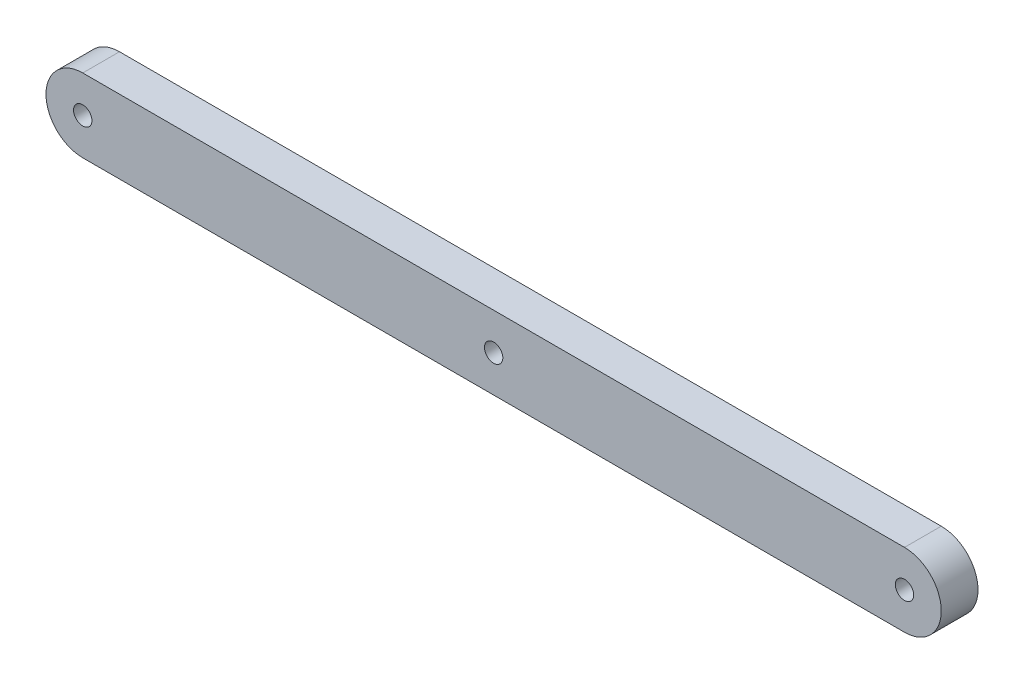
ISO-10303-21;
HEADER;
FILE_DESCRIPTION(('STEP AP214'),'2;1');
FILE_NAME('part.step','',(''),(''),'','','');
FILE_SCHEMA(('AUTOMOTIVE_DESIGN { 1 0 10303 214 1 1 1 1 }'));
ENDSEC;
DATA;
#1=APPLICATION_CONTEXT('core data for automotive mechanical design processes');
#2=APPLICATION_PROTOCOL_DEFINITION('international standard','automotive_design',2000,#1);
#3=PRODUCT_CONTEXT('',#1,'mechanical');
#4=PRODUCT('Part','Part','',(#3));
#5=PRODUCT_RELATED_PRODUCT_CATEGORY('part','',(#4));
#6=PRODUCT_DEFINITION_FORMATION('','',#4);
#7=PRODUCT_DEFINITION_CONTEXT('part definition',#1,'design');
#8=PRODUCT_DEFINITION('design','',#6,#7);
#9=PRODUCT_DEFINITION_SHAPE('','',#8);
#10=(LENGTH_UNIT() NAMED_UNIT(*) SI_UNIT(.MILLI.,.METRE.));
#11=(NAMED_UNIT(*) PLANE_ANGLE_UNIT() SI_UNIT($,.RADIAN.));
#12=(NAMED_UNIT(*) SI_UNIT($,.STERADIAN.) SOLID_ANGLE_UNIT());
#13=UNCERTAINTY_MEASURE_WITH_UNIT(LENGTH_MEASURE(1.E-05),#10,'distance_accuracy_value','');
#14=(GEOMETRIC_REPRESENTATION_CONTEXT(3) GLOBAL_UNCERTAINTY_ASSIGNED_CONTEXT((#13)) GLOBAL_UNIT_ASSIGNED_CONTEXT((#10,
#11,#12)) REPRESENTATION_CONTEXT('',''));
#15=CARTESIAN_POINT('',(0.,0.,0.));
#16=DIRECTION('',(0.,0.,1.));
#17=DIRECTION('',(1.,0.,0.));
#18=AXIS2_PLACEMENT_3D('',#15,#16,#17);
#19=CARTESIAN_POINT('',(0.,0.,2.54));
#20=DIRECTION('',(0.,0.,-1.));
#21=DIRECTION('',(-1.,0.,0.));
#22=AXIS2_PLACEMENT_3D('',#19,#20,#21);
#23=CYLINDRICAL_SURFACE('',#22,2.54);
#24=CARTESIAN_POINT('',(0.,0.,0.));
#25=DIRECTION('',(0.,0.,1.));
#26=DIRECTION('',(1.,0.,0.));
#27=AXIS2_PLACEMENT_3D('',#24,#25,#26);
#28=CIRCLE('',#27,2.54);
#29=CARTESIAN_POINT('',(0.,2.54,0.));
#30=VERTEX_POINT('',#29);
#31=CARTESIAN_POINT('',(0.,-2.54,0.));
#32=VERTEX_POINT('',#31);
#33=EDGE_CURVE('E95',#30,#32,#28,.T.);
#34=ORIENTED_EDGE('',*,*,#33,.T.);
#35=DIRECTION('',(0.,0.,-1.));
#36=VECTOR('',#35,1.);
#37=CARTESIAN_POINT('',(0.,-2.54,2.54));
#38=LINE('',#37,#36);
#39=CARTESIAN_POINT('',(0.,-2.54,2.54));
#40=VERTEX_POINT('',#39);
#41=EDGE_CURVE('E11',#40,#32,#38,.T.);
#42=ORIENTED_EDGE('',*,*,#41,.F.);
#43=CARTESIAN_POINT('',(0.,0.,2.54));
#44=DIRECTION('',(0.,0.,1.));
#45=DIRECTION('',(1.,0.,0.));
#46=AXIS2_PLACEMENT_3D('',#43,#44,#45);
#47=CIRCLE('',#46,2.54);
#48=CARTESIAN_POINT('',(0.,2.54,2.54));
#49=VERTEX_POINT('',#48);
#50=EDGE_CURVE('E83',#49,#40,#47,.T.);
#51=ORIENTED_EDGE('',*,*,#50,.F.);
#52=DIRECTION('',(0.,0.,-1.));
#53=VECTOR('',#52,1.);
#54=CARTESIAN_POINT('',(0.,2.54,2.54));
#55=LINE('',#54,#53);
#56=EDGE_CURVE('E91',#49,#30,#55,.T.);
#57=ORIENTED_EDGE('',*,*,#56,.T.);
#58=EDGE_LOOP('',(#34,#42,#51,#57));
#59=FACE_BOUND('',#58,.T.);
#60=ADVANCED_FACE('F32',(#59),#23,.T.);
#61=CARTESIAN_POINT('',(0.,-2.54,2.54));
#62=DIRECTION('',(0.,1.,0.));
#63=DIRECTION('',(0.,0.,1.));
#64=AXIS2_PLACEMENT_3D('',#61,#62,#63);
#65=PLANE('',#64);
#66=DIRECTION('',(1.,0.,0.));
#67=VECTOR('',#66,1.);
#68=CARTESIAN_POINT('',(0.,-2.54,0.));
#69=LINE('',#68,#67);
#70=CARTESIAN_POINT('',(56.7944,-2.54,0.));
#71=VERTEX_POINT('',#70);
#72=EDGE_CURVE('E87',#32,#71,#69,.T.);
#73=ORIENTED_EDGE('',*,*,#72,.T.);
#74=DIRECTION('',(0.,0.,-1.));
#75=VECTOR('',#74,1.);
#76=CARTESIAN_POINT('',(56.7944,-2.54,2.54));
#77=LINE('',#76,#75);
#78=CARTESIAN_POINT('',(56.7944,-2.54,2.54));
#79=VERTEX_POINT('',#78);
#80=EDGE_CURVE('E40',#79,#71,#77,.T.);
#81=ORIENTED_EDGE('',*,*,#80,.F.);
#82=DIRECTION('',(1.,0.,0.));
#83=VECTOR('',#82,1.);
#84=CARTESIAN_POINT('',(0.,-2.54,2.54));
#85=LINE('',#84,#83);
#86=EDGE_CURVE('E78',#40,#79,#85,.T.);
#87=ORIENTED_EDGE('',*,*,#86,.F.);
#88=ORIENTED_EDGE('',*,*,#41,.T.);
#89=EDGE_LOOP('',(#73,#81,#87,#88));
#90=FACE_BOUND('',#89,.T.);
#91=ADVANCED_FACE('F86',(#90),#65,.F.);
#92=CARTESIAN_POINT('',(56.7944,0.,2.54));
#93=DIRECTION('',(0.,0.,-1.));
#94=DIRECTION('',(-1.,0.,0.));
#95=AXIS2_PLACEMENT_3D('',#92,#93,#94);
#96=CYLINDRICAL_SURFACE('',#95,2.54);
#97=CARTESIAN_POINT('',(56.7944,0.,0.));
#98=DIRECTION('',(0.,0.,1.));
#99=DIRECTION('',(1.,0.,0.));
#100=AXIS2_PLACEMENT_3D('',#97,#98,#99);
#101=CIRCLE('',#100,2.54);
#102=CARTESIAN_POINT('',(56.7944,2.54,0.));
#103=VERTEX_POINT('',#102);
#104=EDGE_CURVE('E65',#71,#103,#101,.T.);
#105=ORIENTED_EDGE('',*,*,#104,.T.);
#106=DIRECTION('',(0.,0.,-1.));
#107=VECTOR('',#106,1.);
#108=CARTESIAN_POINT('',(56.7944,2.54,2.54));
#109=LINE('',#108,#107);
#110=CARTESIAN_POINT('',(56.7944,2.54,2.54));
#111=VERTEX_POINT('',#110);
#112=EDGE_CURVE('E88',#111,#103,#109,.T.);
#113=ORIENTED_EDGE('',*,*,#112,.F.);
#114=CARTESIAN_POINT('',(56.7944,0.,2.54));
#115=DIRECTION('',(0.,0.,1.));
#116=DIRECTION('',(1.,0.,0.));
#117=AXIS2_PLACEMENT_3D('',#114,#115,#116);
#118=CIRCLE('',#117,2.54);
#119=EDGE_CURVE('E81',#79,#111,#118,.T.);
#120=ORIENTED_EDGE('',*,*,#119,.F.);
#121=ORIENTED_EDGE('',*,*,#80,.T.);
#122=EDGE_LOOP('',(#105,#113,#120,#121));
#123=FACE_BOUND('',#122,.T.);
#124=ADVANCED_FACE('F89',(#123),#96,.T.);
#125=CARTESIAN_POINT('',(0.,2.54,2.54));
#126=DIRECTION('',(0.,-1.,0.));
#127=DIRECTION('',(0.,0.,-1.));
#128=AXIS2_PLACEMENT_3D('',#125,#126,#127);
#129=PLANE('',#128);
#130=DIRECTION('',(-1.,0.,0.));
#131=VECTOR('',#130,1.);
#132=CARTESIAN_POINT('',(0.,2.54,0.));
#133=LINE('',#132,#131);
#134=EDGE_CURVE('E71',#103,#30,#133,.T.);
#135=ORIENTED_EDGE('',*,*,#134,.T.);
#136=ORIENTED_EDGE('',*,*,#56,.F.);
#137=DIRECTION('',(-1.,0.,0.));
#138=VECTOR('',#137,1.);
#139=CARTESIAN_POINT('',(0.,2.54,2.54));
#140=LINE('',#139,#138);
#141=EDGE_CURVE('E48',#111,#49,#140,.T.);
#142=ORIENTED_EDGE('',*,*,#141,.F.);
#143=ORIENTED_EDGE('',*,*,#112,.T.);
#144=EDGE_LOOP('',(#135,#136,#142,#143));
#145=FACE_BOUND('',#144,.T.);
#146=ADVANCED_FACE('F103',(#145),#129,.F.);
#147=CARTESIAN_POINT('',(0.,0.,2.54));
#148=DIRECTION('',(0.,0.,1.));
#149=DIRECTION('',(1.,0.,0.));
#150=AXIS2_PLACEMENT_3D('',#147,#148,#149);
#151=PLANE('',#150);
#152=CARTESIAN_POINT('',(28.3972,0.,2.54));
#153=DIRECTION('',(0.,0.,1.));
#154=DIRECTION('',(1.,0.,0.));
#155=AXIS2_PLACEMENT_3D('',#152,#153,#154);
#156=CIRCLE('',#155,0.634999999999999);
#157=CARTESIAN_POINT('',(29.0322,0.,2.54));
#158=VERTEX_POINT('',#157);
#159=EDGE_CURVE('E120',#158,#158,#156,.T.);
#160=ORIENTED_EDGE('',*,*,#159,.F.);
#161=EDGE_LOOP('',(#160));
#162=FACE_BOUND('',#161,.T.);
#163=CARTESIAN_POINT('',(56.7944,0.,2.54));
#164=DIRECTION('',(0.,0.,1.));
#165=DIRECTION('',(1.,0.,0.));
#166=AXIS2_PLACEMENT_3D('',#163,#164,#165);
#167=CIRCLE('',#166,0.635);
#168=CARTESIAN_POINT('',(57.4294,0.,2.54));
#169=VERTEX_POINT('',#168);
#170=EDGE_CURVE('E114',#169,#169,#167,.F.);
#171=ORIENTED_EDGE('',*,*,#170,.T.);
#172=EDGE_LOOP('',(#171));
#173=FACE_BOUND('',#172,.T.);
#174=CARTESIAN_POINT('',(0.,0.,2.54));
#175=DIRECTION('',(0.,0.,1.));
#176=DIRECTION('',(1.,0.,0.));
#177=AXIS2_PLACEMENT_3D('',#174,#175,#176);
#178=CIRCLE('',#177,0.635);
#179=CARTESIAN_POINT('',(0.635,0.,2.54));
#180=VERTEX_POINT('',#179);
#181=EDGE_CURVE('E98',#180,#180,#178,.T.);
#182=ORIENTED_EDGE('',*,*,#181,.F.);
#183=EDGE_LOOP('',(#182));
#184=FACE_BOUND('',#183,.T.);
#185=ORIENTED_EDGE('',*,*,#50,.T.);
#186=ORIENTED_EDGE('',*,*,#86,.T.);
#187=ORIENTED_EDGE('',*,*,#119,.T.);
#188=ORIENTED_EDGE('',*,*,#141,.T.);
#189=EDGE_LOOP('',(#185,#186,#187,#188));
#190=FACE_BOUND('',#189,.T.);
#191=ADVANCED_FACE('F79',(#162,#173,#184,#190),#151,.T.);
#192=CARTESIAN_POINT('',(0.,0.,0.));
#193=DIRECTION('',(0.,0.,1.));
#194=DIRECTION('',(1.,0.,0.));
#195=AXIS2_PLACEMENT_3D('',#192,#193,#194);
#196=PLANE('',#195);
#197=CARTESIAN_POINT('',(28.3972,0.,0.));
#198=DIRECTION('',(0.,0.,1.));
#199=DIRECTION('',(1.,0.,0.));
#200=AXIS2_PLACEMENT_3D('',#197,#198,#199);
#201=CIRCLE('',#200,0.634999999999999);
#202=CARTESIAN_POINT('',(29.0322,0.,0.));
#203=VERTEX_POINT('',#202);
#204=EDGE_CURVE('E123',#203,#203,#201,.T.);
#205=ORIENTED_EDGE('',*,*,#204,.T.);
#206=EDGE_LOOP('',(#205));
#207=FACE_BOUND('',#206,.T.);
#208=CARTESIAN_POINT('',(56.7944,0.,0.));
#209=DIRECTION('',(0.,0.,-1.));
#210=DIRECTION('',(-1.,0.,0.));
#211=AXIS2_PLACEMENT_3D('',#208,#209,#210);
#212=CIRCLE('',#211,0.635);
#213=CARTESIAN_POINT('',(56.1594,0.,0.));
#214=VERTEX_POINT('',#213);
#215=EDGE_CURVE('E117',#214,#214,#212,.T.);
#216=ORIENTED_EDGE('',*,*,#215,.F.);
#217=EDGE_LOOP('',(#216));
#218=FACE_BOUND('',#217,.T.);
#219=CARTESIAN_POINT('',(0.,0.,0.));
#220=DIRECTION('',(0.,0.,1.));
#221=DIRECTION('',(1.,0.,0.));
#222=AXIS2_PLACEMENT_3D('',#219,#220,#221);
#223=CIRCLE('',#222,0.635);
#224=CARTESIAN_POINT('',(0.635,0.,0.));
#225=VERTEX_POINT('',#224);
#226=EDGE_CURVE('E111',#225,#225,#223,.T.);
#227=ORIENTED_EDGE('',*,*,#226,.T.);
#228=EDGE_LOOP('',(#227));
#229=FACE_BOUND('',#228,.T.);
#230=ORIENTED_EDGE('',*,*,#33,.F.);
#231=ORIENTED_EDGE('',*,*,#134,.F.);
#232=ORIENTED_EDGE('',*,*,#104,.F.);
#233=ORIENTED_EDGE('',*,*,#72,.F.);
#234=EDGE_LOOP('',(#230,#231,#232,#233));
#235=FACE_BOUND('',#234,.T.);
#236=ADVANCED_FACE('F106',(#207,#218,#229,#235),#196,.F.);
#237=CARTESIAN_POINT('',(0.,0.,0.));
#238=DIRECTION('',(0.,0.,1.));
#239=DIRECTION('',(1.,0.,0.));
#240=AXIS2_PLACEMENT_3D('',#237,#238,#239);
#241=CYLINDRICAL_SURFACE('',#240,0.635);
#242=ORIENTED_EDGE('',*,*,#181,.T.);
#243=EDGE_LOOP('',(#242));
#244=FACE_BOUND('',#243,.T.);
#245=ORIENTED_EDGE('',*,*,#226,.F.);
#246=EDGE_LOOP('',(#245));
#247=FACE_BOUND('',#246,.T.);
#248=ADVANCED_FACE('F137',(#244,#247),#241,.F.);
#249=CARTESIAN_POINT('',(56.7944,0.,0.));
#250=DIRECTION('',(0.,0.,1.));
#251=DIRECTION('',(1.,0.,0.));
#252=AXIS2_PLACEMENT_3D('',#249,#250,#251);
#253=CYLINDRICAL_SURFACE('',#252,0.635);
#254=ORIENTED_EDGE('',*,*,#170,.F.);
#255=EDGE_LOOP('',(#254));
#256=FACE_BOUND('',#255,.T.);
#257=ORIENTED_EDGE('',*,*,#215,.T.);
#258=EDGE_LOOP('',(#257));
#259=FACE_BOUND('',#258,.T.);
#260=ADVANCED_FACE('F131',(#256,#259),#253,.F.);
#261=CARTESIAN_POINT('',(28.3972,0.,0.));
#262=DIRECTION('',(0.,0.,1.));
#263=DIRECTION('',(1.,0.,0.));
#264=AXIS2_PLACEMENT_3D('',#261,#262,#263);
#265=CYLINDRICAL_SURFACE('',#264,0.634999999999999);
#266=ORIENTED_EDGE('',*,*,#159,.T.);
#267=EDGE_LOOP('',(#266));
#268=FACE_BOUND('',#267,.T.);
#269=ORIENTED_EDGE('',*,*,#204,.F.);
#270=EDGE_LOOP('',(#269));
#271=FACE_BOUND('',#270,.T.);
#272=ADVANCED_FACE('F129',(#268,#271),#265,.F.);
#273=CLOSED_SHELL('',(#60,#91,#124,#146,#191,#236,#248,#260,#272));
#274=MANIFOLD_SOLID_BREP('B2',#273);
#275=ADVANCED_BREP_SHAPE_REPRESENTATION('',(#18,#274),#14);
#276=SHAPE_DEFINITION_REPRESENTATION(#9,#275);
ENDSEC;
END-ISO-10303-21;
